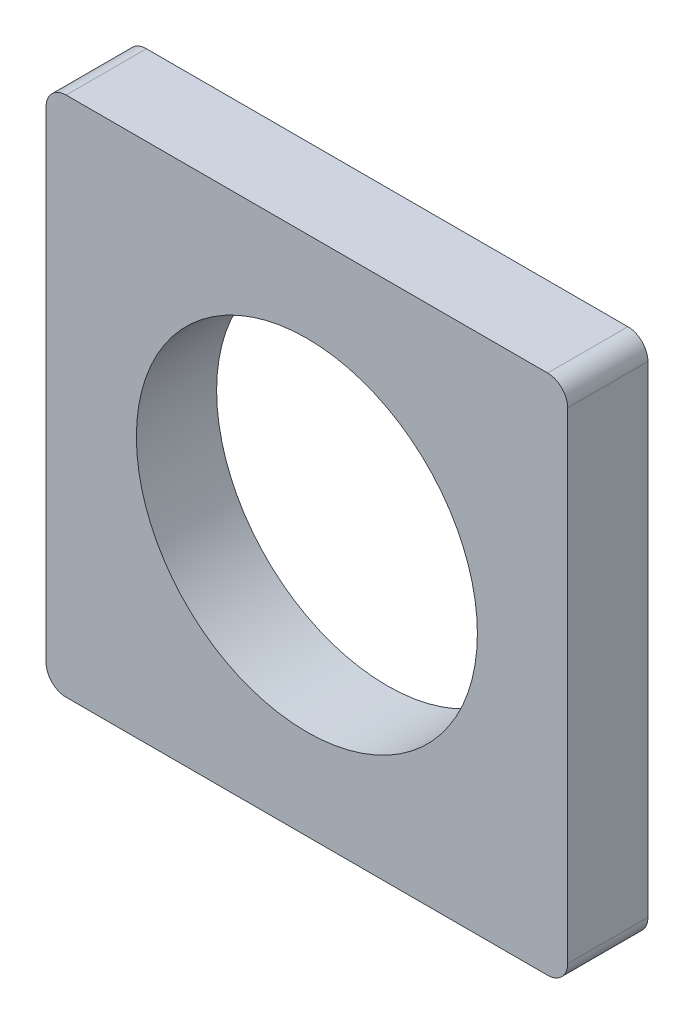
ISO-10303-21;
HEADER;
FILE_DESCRIPTION(('STEP AP214'),'2;1');
FILE_NAME('part.step','',(''),(''),'','','');
FILE_SCHEMA(('AUTOMOTIVE_DESIGN { 1 0 10303 214 1 1 1 1 }'));
ENDSEC;
DATA;
#1=APPLICATION_CONTEXT('core data for automotive mechanical design processes');
#2=APPLICATION_PROTOCOL_DEFINITION('international standard','automotive_design',2000,#1);
#3=PRODUCT_CONTEXT('',#1,'mechanical');
#4=PRODUCT('Part','Part','',(#3));
#5=PRODUCT_RELATED_PRODUCT_CATEGORY('part','',(#4));
#6=PRODUCT_DEFINITION_FORMATION('','',#4);
#7=PRODUCT_DEFINITION_CONTEXT('part definition',#1,'design');
#8=PRODUCT_DEFINITION('design','',#6,#7);
#9=PRODUCT_DEFINITION_SHAPE('','',#8);
#10=(LENGTH_UNIT() NAMED_UNIT(*) SI_UNIT(.MILLI.,.METRE.));
#11=(NAMED_UNIT(*) PLANE_ANGLE_UNIT() SI_UNIT($,.RADIAN.));
#12=(NAMED_UNIT(*) SI_UNIT($,.STERADIAN.) SOLID_ANGLE_UNIT());
#13=UNCERTAINTY_MEASURE_WITH_UNIT(LENGTH_MEASURE(1.E-05),#10,'distance_accuracy_value','');
#14=(GEOMETRIC_REPRESENTATION_CONTEXT(3) GLOBAL_UNCERTAINTY_ASSIGNED_CONTEXT((#13)) GLOBAL_UNIT_ASSIGNED_CONTEXT((#10,
#11,#12)) REPRESENTATION_CONTEXT('',''));
#15=CARTESIAN_POINT('',(0.,0.,0.));
#16=DIRECTION('',(0.,0.,1.));
#17=DIRECTION('',(1.,0.,0.));
#18=AXIS2_PLACEMENT_3D('',#15,#16,#17);
#19=CARTESIAN_POINT('',(0.5,0.5,2.));
#20=DIRECTION('',(0.,0.,1.));
#21=DIRECTION('',(1.,0.,0.));
#22=AXIS2_PLACEMENT_3D('',#19,#20,#21);
#23=PLANE('',#22);
#24=CARTESIAN_POINT('',(0.5,0.5,2.));
#25=DIRECTION('',(0.,0.,1.));
#26=DIRECTION('',(1.,0.,0.));
#27=AXIS2_PLACEMENT_3D('',#24,#25,#26);
#28=CIRCLE('',#27,0.5);
#29=CARTESIAN_POINT('',(0.,0.500000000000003,2.));
#30=VERTEX_POINT('',#29);
#31=CARTESIAN_POINT('',(0.500000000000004,0.,2.));
#32=VERTEX_POINT('',#31);
#33=EDGE_CURVE('E153',#30,#32,#28,.T.);
#34=ORIENTED_EDGE('',*,*,#33,.T.);
#35=DIRECTION('',(1.,0.,0.));
#36=VECTOR('',#35,1.);
#37=CARTESIAN_POINT('',(0.500000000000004,0.,2.));
#38=LINE('',#37,#36);
#39=CARTESIAN_POINT('',(12.5,0.,2.));
#40=VERTEX_POINT('',#39);
#41=EDGE_CURVE('E101',#32,#40,#38,.T.);
#42=ORIENTED_EDGE('',*,*,#41,.T.);
#43=CARTESIAN_POINT('',(12.5,0.5,2.));
#44=DIRECTION('',(0.,0.,1.));
#45=DIRECTION('',(1.,0.,0.));
#46=AXIS2_PLACEMENT_3D('',#43,#44,#45);
#47=CIRCLE('',#46,0.5);
#48=CARTESIAN_POINT('',(13.,0.500000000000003,2.));
#49=VERTEX_POINT('',#48);
#50=EDGE_CURVE('E168',#40,#49,#47,.T.);
#51=ORIENTED_EDGE('',*,*,#50,.T.);
#52=DIRECTION('',(0.,1.,0.));
#53=VECTOR('',#52,1.);
#54=CARTESIAN_POINT('',(13.,0.500000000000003,2.));
#55=LINE('',#54,#53);
#56=CARTESIAN_POINT('',(13.,12.5,2.));
#57=VERTEX_POINT('',#56);
#58=EDGE_CURVE('E181',#49,#57,#55,.T.);
#59=ORIENTED_EDGE('',*,*,#58,.T.);
#60=CARTESIAN_POINT('',(12.5,12.5,2.));
#61=DIRECTION('',(0.,0.,1.));
#62=DIRECTION('',(1.,0.,0.));
#63=AXIS2_PLACEMENT_3D('',#60,#61,#62);
#64=CIRCLE('',#63,0.5);
#65=CARTESIAN_POINT('',(12.5,13.,2.));
#66=VERTEX_POINT('',#65);
#67=EDGE_CURVE('E120',#57,#66,#64,.T.);
#68=ORIENTED_EDGE('',*,*,#67,.T.);
#69=DIRECTION('',(-1.,0.,0.));
#70=VECTOR('',#69,1.);
#71=CARTESIAN_POINT('',(0.500000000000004,13.,2.));
#72=LINE('',#71,#70);
#73=CARTESIAN_POINT('',(0.500000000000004,13.,2.));
#74=VERTEX_POINT('',#73);
#75=EDGE_CURVE('E114',#66,#74,#72,.T.);
#76=ORIENTED_EDGE('',*,*,#75,.T.);
#77=CARTESIAN_POINT('',(0.5,12.5,2.));
#78=DIRECTION('',(0.,0.,1.));
#79=DIRECTION('',(1.,0.,0.));
#80=AXIS2_PLACEMENT_3D('',#77,#78,#79);
#81=CIRCLE('',#80,0.5);
#82=CARTESIAN_POINT('',(0.,12.5,2.));
#83=VERTEX_POINT('',#82);
#84=EDGE_CURVE('E118',#74,#83,#81,.T.);
#85=ORIENTED_EDGE('',*,*,#84,.T.);
#86=DIRECTION('',(0.,-1.,0.));
#87=VECTOR('',#86,1.);
#88=CARTESIAN_POINT('',(0.,0.500000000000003,2.));
#89=LINE('',#88,#87);
#90=EDGE_CURVE('E58',#83,#30,#89,.T.);
#91=ORIENTED_EDGE('',*,*,#90,.T.);
#92=EDGE_LOOP('',(#34,#42,#51,#59,#68,#76,#85,#91));
#93=FACE_BOUND('',#92,.T.);
#94=CARTESIAN_POINT('',(6.5,6.5,2.));
#95=DIRECTION('',(0.,0.,1.));
#96=DIRECTION('',(1.,0.,0.));
#97=AXIS2_PLACEMENT_3D('',#94,#95,#96);
#98=CIRCLE('',#97,4.25);
#99=CARTESIAN_POINT('',(10.75,6.5,2.));
#100=VERTEX_POINT('',#99);
#101=EDGE_CURVE('E142',#100,#100,#98,.T.);
#102=ORIENTED_EDGE('',*,*,#101,.F.);
#103=EDGE_LOOP('',(#102));
#104=FACE_BOUND('',#103,.T.);
#105=ADVANCED_FACE('F41',(#93,#104),#23,.T.);
#106=CARTESIAN_POINT('',(0.5,0.5,0.));
#107=DIRECTION('',(0.,0.,1.));
#108=DIRECTION('',(1.,0.,0.));
#109=AXIS2_PLACEMENT_3D('',#106,#107,#108);
#110=PLANE('',#109);
#111=CARTESIAN_POINT('',(0.5,0.5,0.));
#112=DIRECTION('',(0.,0.,1.));
#113=DIRECTION('',(1.,0.,0.));
#114=AXIS2_PLACEMENT_3D('',#111,#112,#113);
#115=CIRCLE('',#114,0.5);
#116=CARTESIAN_POINT('',(0.,0.500000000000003,0.));
#117=VERTEX_POINT('',#116);
#118=CARTESIAN_POINT('',(0.500000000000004,0.,0.));
#119=VERTEX_POINT('',#118);
#120=EDGE_CURVE('E138',#117,#119,#115,.T.);
#121=ORIENTED_EDGE('',*,*,#120,.F.);
#122=DIRECTION('',(0.,-1.,0.));
#123=VECTOR('',#122,1.);
#124=CARTESIAN_POINT('',(0.,0.500000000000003,0.));
#125=LINE('',#124,#123);
#126=CARTESIAN_POINT('',(0.,12.5,0.));
#127=VERTEX_POINT('',#126);
#128=EDGE_CURVE('E93',#127,#117,#125,.T.);
#129=ORIENTED_EDGE('',*,*,#128,.F.);
#130=CARTESIAN_POINT('',(0.5,12.5,0.));
#131=DIRECTION('',(0.,0.,1.));
#132=DIRECTION('',(1.,0.,0.));
#133=AXIS2_PLACEMENT_3D('',#130,#131,#132);
#134=CIRCLE('',#133,0.5);
#135=CARTESIAN_POINT('',(0.500000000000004,13.,0.));
#136=VERTEX_POINT('',#135);
#137=EDGE_CURVE('E87',#136,#127,#134,.T.);
#138=ORIENTED_EDGE('',*,*,#137,.F.);
#139=DIRECTION('',(-1.,0.,0.));
#140=VECTOR('',#139,1.);
#141=CARTESIAN_POINT('',(0.500000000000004,13.,0.));
#142=LINE('',#141,#140);
#143=CARTESIAN_POINT('',(12.5,13.,0.));
#144=VERTEX_POINT('',#143);
#145=EDGE_CURVE('E128',#144,#136,#142,.T.);
#146=ORIENTED_EDGE('',*,*,#145,.F.);
#147=CARTESIAN_POINT('',(12.5,12.5,0.));
#148=DIRECTION('',(0.,0.,1.));
#149=DIRECTION('',(1.,0.,0.));
#150=AXIS2_PLACEMENT_3D('',#147,#148,#149);
#151=CIRCLE('',#150,0.5);
#152=CARTESIAN_POINT('',(13.,12.5,0.));
#153=VERTEX_POINT('',#152);
#154=EDGE_CURVE('E148',#153,#144,#151,.T.);
#155=ORIENTED_EDGE('',*,*,#154,.F.);
#156=DIRECTION('',(0.,1.,0.));
#157=VECTOR('',#156,1.);
#158=CARTESIAN_POINT('',(13.,0.500000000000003,0.));
#159=LINE('',#158,#157);
#160=CARTESIAN_POINT('',(13.,0.500000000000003,0.));
#161=VERTEX_POINT('',#160);
#162=EDGE_CURVE('E146',#161,#153,#159,.T.);
#163=ORIENTED_EDGE('',*,*,#162,.F.);
#164=CARTESIAN_POINT('',(12.5,0.5,0.));
#165=DIRECTION('',(0.,0.,1.));
#166=DIRECTION('',(1.,0.,0.));
#167=AXIS2_PLACEMENT_3D('',#164,#165,#166);
#168=CIRCLE('',#167,0.5);
#169=CARTESIAN_POINT('',(12.5,0.,0.));
#170=VERTEX_POINT('',#169);
#171=EDGE_CURVE('E144',#170,#161,#168,.T.);
#172=ORIENTED_EDGE('',*,*,#171,.F.);
#173=DIRECTION('',(1.,0.,0.));
#174=VECTOR('',#173,1.);
#175=CARTESIAN_POINT('',(0.500000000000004,0.,0.));
#176=LINE('',#175,#174);
#177=EDGE_CURVE('E141',#119,#170,#176,.T.);
#178=ORIENTED_EDGE('',*,*,#177,.F.);
#179=EDGE_LOOP('',(#121,#129,#138,#146,#155,#163,#172,#178));
#180=FACE_BOUND('',#179,.T.);
#181=CARTESIAN_POINT('',(6.5,6.5,0.));
#182=DIRECTION('',(0.,0.,1.));
#183=DIRECTION('',(1.,0.,0.));
#184=AXIS2_PLACEMENT_3D('',#181,#182,#183);
#185=CIRCLE('',#184,4.25);
#186=CARTESIAN_POINT('',(10.75,6.5,0.));
#187=VERTEX_POINT('',#186);
#188=EDGE_CURVE('E187',#187,#187,#185,.T.);
#189=ORIENTED_EDGE('',*,*,#188,.T.);
#190=EDGE_LOOP('',(#189));
#191=FACE_BOUND('',#190,.T.);
#192=ADVANCED_FACE('F172',(#180,#191),#110,.F.);
#193=CARTESIAN_POINT('',(0.5,0.5,2.));
#194=DIRECTION('',(0.,0.,-1.));
#195=DIRECTION('',(-1.,0.,0.));
#196=AXIS2_PLACEMENT_3D('',#193,#194,#195);
#197=CYLINDRICAL_SURFACE('',#196,0.5);
#198=ORIENTED_EDGE('',*,*,#120,.T.);
#199=DIRECTION('',(0.,0.,-1.));
#200=VECTOR('',#199,1.);
#201=CARTESIAN_POINT('',(0.500000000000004,0.,2.));
#202=LINE('',#201,#200);
#203=EDGE_CURVE('E11',#32,#119,#202,.T.);
#204=ORIENTED_EDGE('',*,*,#203,.F.);
#205=ORIENTED_EDGE('',*,*,#33,.F.);
#206=DIRECTION('',(0.,0.,-1.));
#207=VECTOR('',#206,1.);
#208=CARTESIAN_POINT('',(0.,0.500000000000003,2.));
#209=LINE('',#208,#207);
#210=EDGE_CURVE('E134',#30,#117,#209,.T.);
#211=ORIENTED_EDGE('',*,*,#210,.T.);
#212=EDGE_LOOP('',(#198,#204,#205,#211));
#213=FACE_BOUND('',#212,.T.);
#214=ADVANCED_FACE('F43',(#213),#197,.T.);
#215=CARTESIAN_POINT('',(0.500000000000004,0.,2.));
#216=DIRECTION('',(0.,1.,0.));
#217=DIRECTION('',(0.,0.,1.));
#218=AXIS2_PLACEMENT_3D('',#215,#216,#217);
#219=PLANE('',#218);
#220=ORIENTED_EDGE('',*,*,#177,.T.);
#221=DIRECTION('',(0.,0.,-1.));
#222=VECTOR('',#221,1.);
#223=CARTESIAN_POINT('',(12.5,0.,2.));
#224=LINE('',#223,#222);
#225=EDGE_CURVE('E50',#40,#170,#224,.T.);
#226=ORIENTED_EDGE('',*,*,#225,.F.);
#227=ORIENTED_EDGE('',*,*,#41,.F.);
#228=ORIENTED_EDGE('',*,*,#203,.T.);
#229=EDGE_LOOP('',(#220,#226,#227,#228));
#230=FACE_BOUND('',#229,.T.);
#231=ADVANCED_FACE('F215',(#230),#219,.F.);
#232=CARTESIAN_POINT('',(12.5,0.5,2.));
#233=DIRECTION('',(0.,0.,-1.));
#234=DIRECTION('',(-1.,0.,0.));
#235=AXIS2_PLACEMENT_3D('',#232,#233,#234);
#236=CYLINDRICAL_SURFACE('',#235,0.5);
#237=ORIENTED_EDGE('',*,*,#171,.T.);
#238=DIRECTION('',(0.,0.,-1.));
#239=VECTOR('',#238,1.);
#240=CARTESIAN_POINT('',(13.,0.500000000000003,2.));
#241=LINE('',#240,#239);
#242=EDGE_CURVE('E160',#49,#161,#241,.T.);
#243=ORIENTED_EDGE('',*,*,#242,.F.);
#244=ORIENTED_EDGE('',*,*,#50,.F.);
#245=ORIENTED_EDGE('',*,*,#225,.T.);
#246=EDGE_LOOP('',(#237,#243,#244,#245));
#247=FACE_BOUND('',#246,.T.);
#248=ADVANCED_FACE('F166',(#247),#236,.T.);
#249=CARTESIAN_POINT('',(13.,0.500000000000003,2.));
#250=DIRECTION('',(-1.,0.,0.));
#251=DIRECTION('',(0.,-1.,0.));
#252=AXIS2_PLACEMENT_3D('',#249,#250,#251);
#253=PLANE('',#252);
#254=ORIENTED_EDGE('',*,*,#162,.T.);
#255=DIRECTION('',(0.,0.,-1.));
#256=VECTOR('',#255,1.);
#257=CARTESIAN_POINT('',(13.,12.5,2.));
#258=LINE('',#257,#256);
#259=EDGE_CURVE('E157',#57,#153,#258,.T.);
#260=ORIENTED_EDGE('',*,*,#259,.F.);
#261=ORIENTED_EDGE('',*,*,#58,.F.);
#262=ORIENTED_EDGE('',*,*,#242,.T.);
#263=EDGE_LOOP('',(#254,#260,#261,#262));
#264=FACE_BOUND('',#263,.T.);
#265=ADVANCED_FACE('F177',(#264),#253,.F.);
#266=CARTESIAN_POINT('',(12.5,12.5,2.));
#267=DIRECTION('',(0.,0.,-1.));
#268=DIRECTION('',(-1.,0.,0.));
#269=AXIS2_PLACEMENT_3D('',#266,#267,#268);
#270=CYLINDRICAL_SURFACE('',#269,0.5);
#271=ORIENTED_EDGE('',*,*,#154,.T.);
#272=DIRECTION('',(0.,0.,-1.));
#273=VECTOR('',#272,1.);
#274=CARTESIAN_POINT('',(12.5,13.,2.));
#275=LINE('',#274,#273);
#276=EDGE_CURVE('E129',#66,#144,#275,.T.);
#277=ORIENTED_EDGE('',*,*,#276,.F.);
#278=ORIENTED_EDGE('',*,*,#67,.F.);
#279=ORIENTED_EDGE('',*,*,#259,.T.);
#280=EDGE_LOOP('',(#271,#277,#278,#279));
#281=FACE_BOUND('',#280,.T.);
#282=ADVANCED_FACE('F180',(#281),#270,.T.);
#283=CARTESIAN_POINT('',(0.500000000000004,13.,2.));
#284=DIRECTION('',(0.,-1.,0.));
#285=DIRECTION('',(0.,0.,-1.));
#286=AXIS2_PLACEMENT_3D('',#283,#284,#285);
#287=PLANE('',#286);
#288=ORIENTED_EDGE('',*,*,#145,.T.);
#289=DIRECTION('',(0.,0.,-1.));
#290=VECTOR('',#289,1.);
#291=CARTESIAN_POINT('',(0.500000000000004,13.,2.));
#292=LINE('',#291,#290);
#293=EDGE_CURVE('E125',#74,#136,#292,.T.);
#294=ORIENTED_EDGE('',*,*,#293,.F.);
#295=ORIENTED_EDGE('',*,*,#75,.F.);
#296=ORIENTED_EDGE('',*,*,#276,.T.);
#297=EDGE_LOOP('',(#288,#294,#295,#296));
#298=FACE_BOUND('',#297,.T.);
#299=ADVANCED_FACE('F126',(#298),#287,.F.);
#300=CARTESIAN_POINT('',(0.5,12.5,2.));
#301=DIRECTION('',(0.,0.,-1.));
#302=DIRECTION('',(-1.,0.,0.));
#303=AXIS2_PLACEMENT_3D('',#300,#301,#302);
#304=CYLINDRICAL_SURFACE('',#303,0.5);
#305=ORIENTED_EDGE('',*,*,#137,.T.);
#306=DIRECTION('',(0.,0.,-1.));
#307=VECTOR('',#306,1.);
#308=CARTESIAN_POINT('',(0.,12.5,2.));
#309=LINE('',#308,#307);
#310=EDGE_CURVE('E130',#83,#127,#309,.T.);
#311=ORIENTED_EDGE('',*,*,#310,.F.);
#312=ORIENTED_EDGE('',*,*,#84,.F.);
#313=ORIENTED_EDGE('',*,*,#293,.T.);
#314=EDGE_LOOP('',(#305,#311,#312,#313));
#315=FACE_BOUND('',#314,.T.);
#316=ADVANCED_FACE('F132',(#315),#304,.T.);
#317=CARTESIAN_POINT('',(0.,0.500000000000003,2.));
#318=DIRECTION('',(1.,0.,0.));
#319=DIRECTION('',(0.,0.,-1.));
#320=AXIS2_PLACEMENT_3D('',#317,#318,#319);
#321=PLANE('',#320);
#322=ORIENTED_EDGE('',*,*,#128,.T.);
#323=ORIENTED_EDGE('',*,*,#210,.F.);
#324=ORIENTED_EDGE('',*,*,#90,.F.);
#325=ORIENTED_EDGE('',*,*,#310,.T.);
#326=EDGE_LOOP('',(#322,#323,#324,#325));
#327=FACE_BOUND('',#326,.T.);
#328=ADVANCED_FACE('F203',(#327),#321,.F.);
#329=CARTESIAN_POINT('',(6.5,6.5,2.));
#330=DIRECTION('',(0.,0.,-1.));
#331=DIRECTION('',(-1.,0.,0.));
#332=AXIS2_PLACEMENT_3D('',#329,#330,#331);
#333=CYLINDRICAL_SURFACE('',#332,4.25);
#334=ORIENTED_EDGE('',*,*,#101,.T.);
#335=EDGE_LOOP('',(#334));
#336=FACE_BOUND('',#335,.T.);
#337=ORIENTED_EDGE('',*,*,#188,.F.);
#338=EDGE_LOOP('',(#337));
#339=FACE_BOUND('',#338,.T.);
#340=ADVANCED_FACE('F193',(#336,#339),#333,.F.);
#341=CLOSED_SHELL('',(#105,#192,#214,#231,#248,#265,#282,#299,#316,#328,#340));
#342=MANIFOLD_SOLID_BREP('B2',#341);
#343=ADVANCED_BREP_SHAPE_REPRESENTATION('',(#18,#342),#14);
#344=SHAPE_DEFINITION_REPRESENTATION(#9,#343);
ENDSEC;
END-ISO-10303-21;
